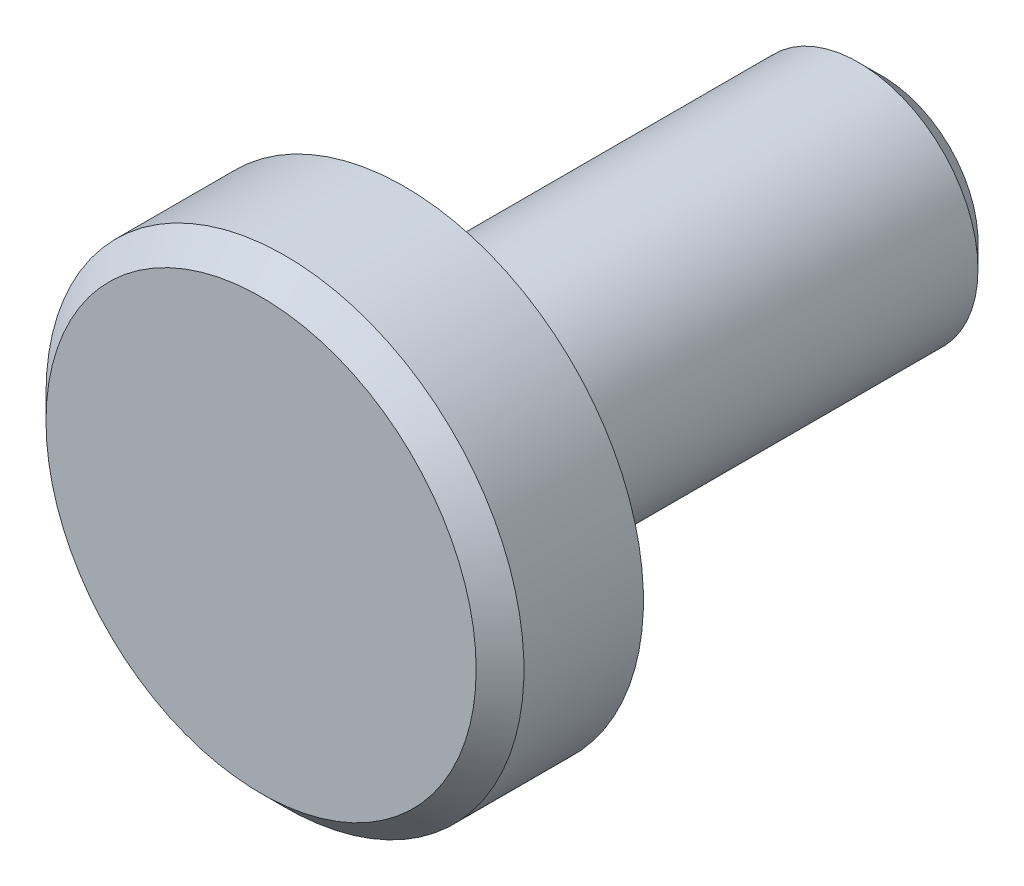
from build123d import *

# Parameters (mm, degrees)
SKETCH1_R           = 7.9375
BASE_EXTRUDE_DEPTH  = 4.7625
SKETCH2_R           = 3.96875
BOSS_EXTRUDE1_DEPTH = 15.875
CHAMFER1_SIZE       = 0.79375


with BuildPart() as part:
    # Sketch1 → Base-Extrude (new body)
    with BuildSketch(Plane.XY):
        with Locations(Location((0, 0, 0), (0, 0, 180))):
            Circle(SKETCH1_R)
    extrude(amount=BASE_EXTRUDE_DEPTH)

    # Sketch2 → Boss-Extrude1 (add)
    with BuildSketch(Plane(origin=(0, 0, 0), x_dir=(-1, 0, 0), z_dir=(0, 0, -1))):
        with Locations(Location((0, 0, 0), (0, 0, 180))):
            Circle(SKETCH2_R)
    extrude(amount=BOSS_EXTRUDE1_DEPTH)

    # Chamfer1
    chamfer1_edges = [part.edges().sort_by_distance(p)[0] for p in [
        (7.9375, 0, 4.7625),
        (-3.96875, 0, -15.875),
    ]]
    chamfer(chamfer1_edges, length=CHAMFER1_SIZE)


solid = part.part
